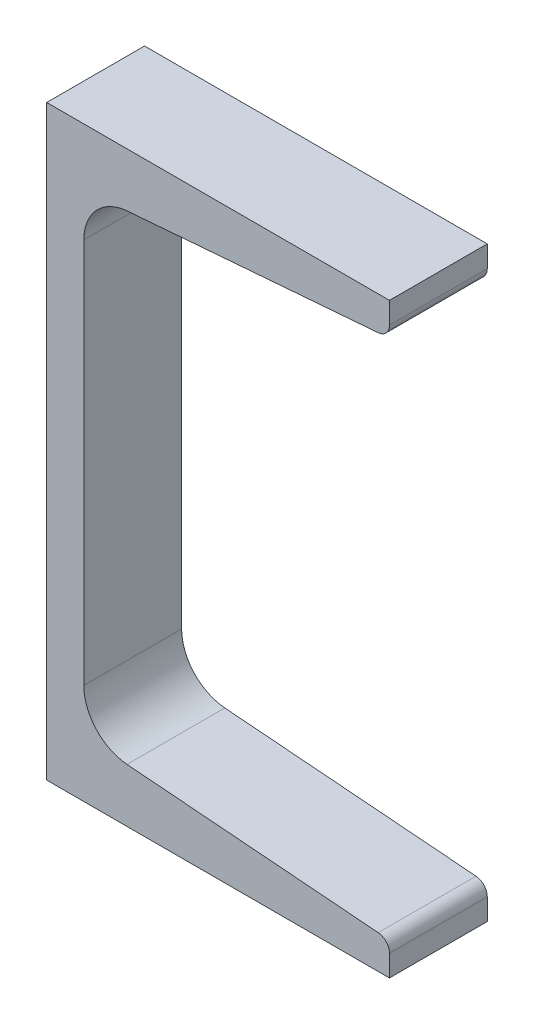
from build123d import *

# Parameters (mm, degrees)
BASEMCHANNEL_DEPTH = 12.7
TOEFILLET_R        = 3.175


with BuildPart() as part:
    # Sketch1 → BaseMchannel (new, symmetric)
    with BuildSketch(Plane.XY):
        with BuildLine():
            Line((89.0016, 152.4), (0, 152.4))
            Line((0, 152.4), (0, 0))
            Line((0, 0), (89.0016, 0))
            Line((89.0016, 0), (89.0016, 8.504952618))
            Line((89.0016, 8.504952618), (20.846350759, 13.957347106))
            ThreePointArc((20.846350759, 13.957347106), (12.860404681, 17.840356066), (9.6266, 26.110519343))
            Line((9.6266, 26.110519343), (9.6266, 126.289480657))
            ThreePointArc((9.6266, 126.289480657), (12.860404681, 134.559643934), (20.846350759, 138.442652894))
            Line((20.846350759, 138.442652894), (89.0016, 143.895047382))
            Line((89.0016, 143.895047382), (89.0016, 152.4))
        make_face()
    extrude(amount=BASEMCHANNEL_DEPTH, both=True)

    # ToeFillet
    toefillet_edges = [part.edges().sort_by_distance(p)[0] for p in [
        (89.0016, 143.895047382, 0),
        (89.0016, 8.504952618, 0),
    ]]
    fillet(toefillet_edges, radius=TOEFILLET_R)


solid = part.part
